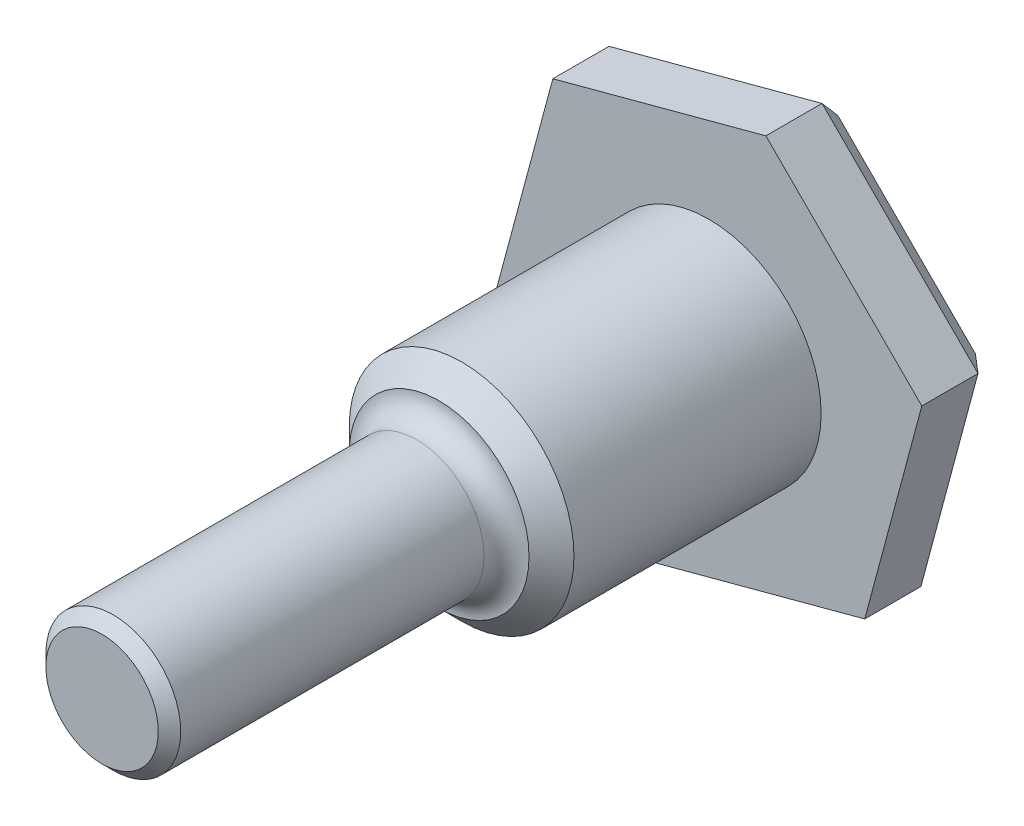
ISO-10303-21;
HEADER;
FILE_DESCRIPTION(('STEP AP214'),'2;1');
FILE_NAME('part.step','',(''),(''),'','','');
FILE_SCHEMA(('AUTOMOTIVE_DESIGN { 1 0 10303 214 1 1 1 1 }'));
ENDSEC;
DATA;
#1=APPLICATION_CONTEXT('core data for automotive mechanical design processes');
#2=APPLICATION_PROTOCOL_DEFINITION('international standard','automotive_design',2000,#1);
#3=PRODUCT_CONTEXT('',#1,'mechanical');
#4=PRODUCT('Part','Part','',(#3));
#5=PRODUCT_RELATED_PRODUCT_CATEGORY('part','',(#4));
#6=PRODUCT_DEFINITION_FORMATION('','',#4);
#7=PRODUCT_DEFINITION_CONTEXT('part definition',#1,'design');
#8=PRODUCT_DEFINITION('design','',#6,#7);
#9=PRODUCT_DEFINITION_SHAPE('','',#8);
#10=(LENGTH_UNIT() NAMED_UNIT(*) SI_UNIT(.MILLI.,.METRE.));
#11=(NAMED_UNIT(*) PLANE_ANGLE_UNIT() SI_UNIT($,.RADIAN.));
#12=(NAMED_UNIT(*) SI_UNIT($,.STERADIAN.) SOLID_ANGLE_UNIT());
#13=UNCERTAINTY_MEASURE_WITH_UNIT(LENGTH_MEASURE(1.E-05),#10,'distance_accuracy_value','');
#14=(GEOMETRIC_REPRESENTATION_CONTEXT(3) GLOBAL_UNCERTAINTY_ASSIGNED_CONTEXT((#13)) GLOBAL_UNIT_ASSIGNED_CONTEXT((#10,
#11,#12)) REPRESENTATION_CONTEXT('',''));
#15=CARTESIAN_POINT('',(0.,0.,0.));
#16=DIRECTION('',(0.,0.,1.));
#17=DIRECTION('',(1.,0.,0.));
#18=AXIS2_PLACEMENT_3D('',#15,#16,#17);
#19=CARTESIAN_POINT('',(6.94022093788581,-6.94022093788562,3.5));
#20=DIRECTION('',(0.,0.,1.));
#21=DIRECTION('',(1.,0.,0.));
#22=AXIS2_PLACEMENT_3D('',#19,#20,#21);
#23=PLANE('',#22);
#24=DIRECTION('',(0.965925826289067,0.258819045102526,0.));
#25=VECTOR('',#24,1.);
#26=CARTESIAN_POINT('',(-2.54029717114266,-9.48051810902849,3.5));
#27=LINE('',#26,#25);
#28=CARTESIAN_POINT('',(-2.54029717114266,-9.48051810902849,3.5));
#29=VERTEX_POINT('',#28);
#30=CARTESIAN_POINT('',(6.94022093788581,-6.94022093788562,3.5));
#31=VERTEX_POINT('',#30);
#32=EDGE_CURVE('E120',#29,#31,#27,.T.);
#33=ORIENTED_EDGE('',*,*,#32,.T.);
#34=DIRECTION('',(0.258819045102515,0.96592582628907,0.));
#35=VECTOR('',#34,1.);
#36=CARTESIAN_POINT('',(6.94022093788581,-6.94022093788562,3.5));
#37=LINE('',#36,#35);
#38=CARTESIAN_POINT('',(9.48051810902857,2.54029717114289,3.5));
#39=VERTEX_POINT('',#38);
#40=EDGE_CURVE('E108',#31,#39,#37,.T.);
#41=ORIENTED_EDGE('',*,*,#40,.T.);
#42=DIRECTION('',(-0.707106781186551,0.707106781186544,0.));
#43=VECTOR('',#42,1.);
#44=CARTESIAN_POINT('',(9.48051810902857,2.54029717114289,3.5));
#45=LINE('',#44,#43);
#46=CARTESIAN_POINT('',(2.54029717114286,9.48051810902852,3.5));
#47=VERTEX_POINT('',#46);
#48=EDGE_CURVE('E119',#39,#47,#45,.T.);
#49=ORIENTED_EDGE('',*,*,#48,.T.);
#50=DIRECTION('',(-0.965925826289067,-0.258819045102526,0.));
#51=VECTOR('',#50,1.);
#52=CARTESIAN_POINT('',(2.54029717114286,9.48051810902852,3.5));
#53=LINE('',#52,#51);
#54=CARTESIAN_POINT('',(-6.9402209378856,6.94022093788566,3.5));
#55=VERTEX_POINT('',#54);
#56=EDGE_CURVE('E401',#47,#55,#53,.T.);
#57=ORIENTED_EDGE('',*,*,#56,.T.);
#58=DIRECTION('',(-0.258819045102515,-0.96592582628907,0.));
#59=VECTOR('',#58,1.);
#60=CARTESIAN_POINT('',(-6.9402209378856,6.94022093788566,3.5));
#61=LINE('',#60,#59);
#62=CARTESIAN_POINT('',(-9.48051810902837,-2.54029717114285,3.5));
#63=VERTEX_POINT('',#62);
#64=EDGE_CURVE('E403',#55,#63,#61,.T.);
#65=ORIENTED_EDGE('',*,*,#64,.T.);
#66=DIRECTION('',(0.707106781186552,-0.707106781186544,0.));
#67=VECTOR('',#66,1.);
#68=CARTESIAN_POINT('',(-9.48051810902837,-2.54029717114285,3.5));
#69=LINE('',#68,#67);
#70=EDGE_CURVE('E125',#63,#29,#69,.T.);
#71=ORIENTED_EDGE('',*,*,#70,.T.);
#72=EDGE_LOOP('',(#33,#41,#49,#57,#65,#71));
#73=FACE_BOUND('',#72,.T.);
#74=CARTESIAN_POINT('',(0.,0.,3.5));
#75=DIRECTION('',(0.,0.,1.));
#76=DIRECTION('',(1.,0.,0.));
#77=AXIS2_PLACEMENT_3D('',#74,#75,#76);
#78=CIRCLE('',#77,5.);
#79=CARTESIAN_POINT('',(5.,0.,3.5));
#80=VERTEX_POINT('',#79);
#81=EDGE_CURVE('E127',#80,#80,#78,.T.);
#82=ORIENTED_EDGE('',*,*,#81,.F.);
#83=EDGE_LOOP('',(#82));
#84=FACE_BOUND('',#83,.T.);
#85=ADVANCED_FACE('F34',(#73,#84),#23,.T.);
#86=CARTESIAN_POINT('',(-2.54029717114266,-9.48051810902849,3.5));
#87=DIRECTION('',(-0.258819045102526,0.965925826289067,0.));
#88=DIRECTION('',(-0.965925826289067,-0.258819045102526,0.));
#89=AXIS2_PLACEMENT_3D('',#86,#87,#88);
#90=PLANE('',#89);
#91=DIRECTION('',(0.,0.,-1.));
#92=VECTOR('',#91,1.);
#93=CARTESIAN_POINT('',(-2.54029717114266,-9.48051810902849,3.5));
#94=LINE('',#93,#92);
#95=CARTESIAN_POINT('',(-2.54029717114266,-9.48051810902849,1.00000000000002));
#96=VERTEX_POINT('',#95);
#97=EDGE_CURVE('E406',#29,#96,#94,.T.);
#98=ORIENTED_EDGE('',*,*,#97,.T.);
#99=DIRECTION('',(0.965925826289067,0.258819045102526,0.));
#100=VECTOR('',#99,1.);
#101=CARTESIAN_POINT('',(-2.54029717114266,-9.48051810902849,1.00000000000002));
#102=LINE('',#101,#100);
#103=CARTESIAN_POINT('',(6.94022093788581,-6.94022093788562,1.00000000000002));
#104=VERTEX_POINT('',#103);
#105=EDGE_CURVE('E130',#96,#104,#102,.T.);
#106=ORIENTED_EDGE('',*,*,#105,.T.);
#107=DIRECTION('',(0.,0.,-1.));
#108=VECTOR('',#107,1.);
#109=CARTESIAN_POINT('',(6.94022093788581,-6.94022093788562,3.5));
#110=LINE('',#109,#108);
#111=EDGE_CURVE('E113',#31,#104,#110,.T.);
#112=ORIENTED_EDGE('',*,*,#111,.F.);
#113=ORIENTED_EDGE('',*,*,#32,.F.);
#114=EDGE_LOOP('',(#98,#106,#112,#113));
#115=FACE_BOUND('',#114,.T.);
#116=ADVANCED_FACE('F36',(#115),#90,.F.);
#117=CARTESIAN_POINT('',(6.94022093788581,-6.94022093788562,3.5));
#118=DIRECTION('',(-0.96592582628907,0.258819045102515,0.));
#119=DIRECTION('',(-0.258819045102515,-0.96592582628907,0.));
#120=AXIS2_PLACEMENT_3D('',#117,#118,#119);
#121=PLANE('',#120);
#122=ORIENTED_EDGE('',*,*,#111,.T.);
#123=DIRECTION('',(0.258819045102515,0.96592582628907,0.));
#124=VECTOR('',#123,1.);
#125=CARTESIAN_POINT('',(6.94022093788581,-6.94022093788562,1.00000000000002));
#126=LINE('',#125,#124);
#127=CARTESIAN_POINT('',(9.48051810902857,2.54029717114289,1.00000000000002));
#128=VERTEX_POINT('',#127);
#129=EDGE_CURVE('E142',#104,#128,#126,.T.);
#130=ORIENTED_EDGE('',*,*,#129,.T.);
#131=DIRECTION('',(0.,0.,-1.));
#132=VECTOR('',#131,1.);
#133=CARTESIAN_POINT('',(9.48051810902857,2.54029717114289,3.5));
#134=LINE('',#133,#132);
#135=EDGE_CURVE('E116',#39,#128,#134,.T.);
#136=ORIENTED_EDGE('',*,*,#135,.F.);
#137=ORIENTED_EDGE('',*,*,#40,.F.);
#138=EDGE_LOOP('',(#122,#130,#136,#137));
#139=FACE_BOUND('',#138,.T.);
#140=ADVANCED_FACE('F110',(#139),#121,.F.);
#141=CARTESIAN_POINT('',(9.48051810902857,2.54029717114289,3.5));
#142=DIRECTION('',(-0.707106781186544,-0.707106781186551,0.));
#143=DIRECTION('',(0.707106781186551,-0.707106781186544,0.));
#144=AXIS2_PLACEMENT_3D('',#141,#142,#143);
#145=PLANE('',#144);
#146=ORIENTED_EDGE('',*,*,#135,.T.);
#147=DIRECTION('',(-0.707106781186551,0.707106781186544,0.));
#148=VECTOR('',#147,1.);
#149=CARTESIAN_POINT('',(9.48051810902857,2.54029717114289,1.00000000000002));
#150=LINE('',#149,#148);
#151=CARTESIAN_POINT('',(2.54029717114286,9.48051810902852,1.00000000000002));
#152=VERTEX_POINT('',#151);
#153=EDGE_CURVE('E157',#128,#152,#150,.T.);
#154=ORIENTED_EDGE('',*,*,#153,.T.);
#155=DIRECTION('',(0.,0.,-1.));
#156=VECTOR('',#155,1.);
#157=CARTESIAN_POINT('',(2.54029717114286,9.48051810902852,3.5));
#158=LINE('',#157,#156);
#159=EDGE_CURVE('E136',#47,#152,#158,.T.);
#160=ORIENTED_EDGE('',*,*,#159,.F.);
#161=ORIENTED_EDGE('',*,*,#48,.F.);
#162=EDGE_LOOP('',(#146,#154,#160,#161));
#163=FACE_BOUND('',#162,.T.);
#164=ADVANCED_FACE('F202',(#163),#145,.F.);
#165=CARTESIAN_POINT('',(2.54029717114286,9.48051810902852,3.5));
#166=DIRECTION('',(0.258819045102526,-0.965925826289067,0.));
#167=DIRECTION('',(0.965925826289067,0.258819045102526,0.));
#168=AXIS2_PLACEMENT_3D('',#165,#166,#167);
#169=PLANE('',#168);
#170=ORIENTED_EDGE('',*,*,#159,.T.);
#171=DIRECTION('',(-0.965925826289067,-0.258819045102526,0.));
#172=VECTOR('',#171,1.);
#173=CARTESIAN_POINT('',(2.54029717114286,9.48051810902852,1.00000000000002));
#174=LINE('',#173,#172);
#175=CARTESIAN_POINT('',(-6.9402209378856,6.94022093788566,1.00000000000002));
#176=VERTEX_POINT('',#175);
#177=EDGE_CURVE('E159',#152,#176,#174,.T.);
#178=ORIENTED_EDGE('',*,*,#177,.T.);
#179=DIRECTION('',(0.,0.,-1.));
#180=VECTOR('',#179,1.);
#181=CARTESIAN_POINT('',(-6.9402209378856,6.94022093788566,3.5));
#182=LINE('',#181,#180);
#183=EDGE_CURVE('E410',#55,#176,#182,.T.);
#184=ORIENTED_EDGE('',*,*,#183,.F.);
#185=ORIENTED_EDGE('',*,*,#56,.F.);
#186=EDGE_LOOP('',(#170,#178,#184,#185));
#187=FACE_BOUND('',#186,.T.);
#188=ADVANCED_FACE('F199',(#187),#169,.F.);
#189=CARTESIAN_POINT('',(-6.9402209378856,6.94022093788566,3.5));
#190=DIRECTION('',(0.96592582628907,-0.258819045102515,0.));
#191=DIRECTION('',(0.258819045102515,0.96592582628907,0.));
#192=AXIS2_PLACEMENT_3D('',#189,#190,#191);
#193=PLANE('',#192);
#194=ORIENTED_EDGE('',*,*,#183,.T.);
#195=DIRECTION('',(-0.258819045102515,-0.96592582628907,0.));
#196=VECTOR('',#195,1.);
#197=CARTESIAN_POINT('',(-6.9402209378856,6.94022093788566,1.00000000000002));
#198=LINE('',#197,#196);
#199=CARTESIAN_POINT('',(-9.48051810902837,-2.54029717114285,1.00000000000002));
#200=VERTEX_POINT('',#199);
#201=EDGE_CURVE('E57',#176,#200,#198,.T.);
#202=ORIENTED_EDGE('',*,*,#201,.T.);
#203=DIRECTION('',(0.,0.,-1.));
#204=VECTOR('',#203,1.);
#205=CARTESIAN_POINT('',(-9.48051810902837,-2.54029717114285,3.5));
#206=LINE('',#205,#204);
#207=EDGE_CURVE('E408',#63,#200,#206,.T.);
#208=ORIENTED_EDGE('',*,*,#207,.F.);
#209=ORIENTED_EDGE('',*,*,#64,.F.);
#210=EDGE_LOOP('',(#194,#202,#208,#209));
#211=FACE_BOUND('',#210,.T.);
#212=ADVANCED_FACE('F196',(#211),#193,.F.);
#213=CARTESIAN_POINT('',(-9.48051810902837,-2.54029717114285,3.5));
#214=DIRECTION('',(0.707106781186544,0.707106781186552,0.));
#215=DIRECTION('',(-0.707106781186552,0.707106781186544,0.));
#216=AXIS2_PLACEMENT_3D('',#213,#214,#215);
#217=PLANE('',#216);
#218=ORIENTED_EDGE('',*,*,#207,.T.);
#219=DIRECTION('',(0.707106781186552,-0.707106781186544,0.));
#220=VECTOR('',#219,1.);
#221=CARTESIAN_POINT('',(-9.48051810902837,-2.54029717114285,1.00000000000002));
#222=LINE('',#221,#220);
#223=EDGE_CURVE('E49',#200,#96,#222,.T.);
#224=ORIENTED_EDGE('',*,*,#223,.T.);
#225=ORIENTED_EDGE('',*,*,#97,.F.);
#226=ORIENTED_EDGE('',*,*,#70,.F.);
#227=EDGE_LOOP('',(#218,#224,#225,#226));
#228=FACE_BOUND('',#227,.T.);
#229=ADVANCED_FACE('F193',(#228),#217,.F.);
#230=CARTESIAN_POINT('',(6.94022093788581,-6.94022093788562,0.));
#231=DIRECTION('',(0.,0.,1.));
#232=DIRECTION('',(1.,0.,0.));
#233=AXIS2_PLACEMENT_3D('',#230,#231,#232);
#234=PLANE('',#233);
#235=DIRECTION('',(0.707106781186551,-0.707106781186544,0.));
#236=VECTOR('',#235,1.);
#237=CARTESIAN_POINT('',(12.2435217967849,-1.63692007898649,0.));
#238=LINE('',#237,#236);
#239=CARTESIAN_POINT('',(2.24143868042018,8.3651630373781,0.));
#240=VERTEX_POINT('',#239);
#241=CARTESIAN_POINT('',(8.36516303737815,2.2414386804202,0.));
#242=VERTEX_POINT('',#241);
#243=EDGE_CURVE('E152',#240,#242,#238,.T.);
#244=ORIENTED_EDGE('',*,*,#243,.T.);
#245=DIRECTION('',(-0.258819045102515,-0.96592582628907,0.));
#246=VECTOR('',#245,1.);
#247=CARTESIAN_POINT('',(5.97429511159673,-6.6814018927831,0.));
#248=LINE('',#247,#246);
#249=CARTESIAN_POINT('',(6.12372435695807,-6.12372435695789,0.));
#250=VERTEX_POINT('',#249);
#251=EDGE_CURVE('E154',#242,#250,#248,.T.);
#252=ORIENTED_EDGE('',*,*,#251,.T.);
#253=DIRECTION('',(-0.965925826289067,-0.258819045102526,0.));
#254=VECTOR('',#253,1.);
#255=CARTESIAN_POINT('',(6.68140189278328,-5.97429511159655,0.));
#256=LINE('',#255,#254);
#257=CARTESIAN_POINT('',(-2.24143868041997,-8.36516303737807,0.));
#258=VERTEX_POINT('',#257);
#259=EDGE_CURVE('E144',#250,#258,#256,.T.);
#260=ORIENTED_EDGE('',*,*,#259,.T.);
#261=DIRECTION('',(-0.707106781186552,0.707106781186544,0.));
#262=VECTOR('',#261,1.);
#263=CARTESIAN_POINT('',(1.63692007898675,-12.2435217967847,0.));
#264=LINE('',#263,#262);
#265=CARTESIAN_POINT('',(-8.36516303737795,-2.24143868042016,0.));
#266=VERTEX_POINT('',#265);
#267=EDGE_CURVE('E146',#258,#266,#264,.T.);
#268=ORIENTED_EDGE('',*,*,#267,.T.);
#269=DIRECTION('',(0.258819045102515,0.96592582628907,0.));
#270=VECTOR('',#269,1.);
#271=CARTESIAN_POINT('',(-8.5145922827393,-2.79911621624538,0.));
#272=LINE('',#271,#270);
#273=CARTESIAN_POINT('',(-6.12372435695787,6.12372435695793,0.));
#274=VERTEX_POINT('',#273);
#275=EDGE_CURVE('E148',#266,#274,#272,.T.);
#276=ORIENTED_EDGE('',*,*,#275,.T.);
#277=DIRECTION('',(0.965925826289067,0.258819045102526,0.));
#278=VECTOR('',#277,1.);
#279=CARTESIAN_POINT('',(2.79911621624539,8.51459228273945,0.));
#280=LINE('',#279,#278);
#281=EDGE_CURVE('E150',#274,#240,#280,.T.);
#282=ORIENTED_EDGE('',*,*,#281,.T.);
#283=EDGE_LOOP('',(#244,#252,#260,#268,#276,#282));
#284=FACE_BOUND('',#283,.T.);
#285=ADVANCED_FACE('F191',(#284),#234,.F.);
#286=CARTESIAN_POINT('',(0.,0.,15.5));
#287=DIRECTION('',(0.,0.,-1.));
#288=DIRECTION('',(-1.,0.,0.));
#289=AXIS2_PLACEMENT_3D('',#286,#287,#288);
#290=CYLINDRICAL_SURFACE('',#289,5.);
#291=CARTESIAN_POINT('',(0.,0.,14.5));
#292=DIRECTION('',(0.,0.,1.));
#293=DIRECTION('',(1.,0.,0.));
#294=AXIS2_PLACEMENT_3D('',#291,#292,#293);
#295=CIRCLE('',#294,5.);
#296=CARTESIAN_POINT('',(5.,0.,14.5));
#297=VERTEX_POINT('',#296);
#298=EDGE_CURVE('E164',#297,#297,#295,.F.);
#299=ORIENTED_EDGE('',*,*,#298,.T.);
#300=EDGE_LOOP('',(#299));
#301=FACE_BOUND('',#300,.T.);
#302=ORIENTED_EDGE('',*,*,#81,.T.);
#303=EDGE_LOOP('',(#302));
#304=FACE_BOUND('',#303,.T.);
#305=ADVANCED_FACE('F235',(#301,#304),#290,.T.);
#306=CARTESIAN_POINT('',(0.,0.,30.5));
#307=DIRECTION('',(0.,0.,-1.));
#308=DIRECTION('',(-1.,0.,0.));
#309=AXIS2_PLACEMENT_3D('',#306,#307,#308);
#310=CYLINDRICAL_SURFACE('',#309,3.);
#311=CARTESIAN_POINT('',(0.,0.,30.));
#312=DIRECTION('',(0.,0.,1.));
#313=DIRECTION('',(1.,0.,0.));
#314=AXIS2_PLACEMENT_3D('',#311,#312,#313);
#315=CIRCLE('',#314,3.);
#316=CARTESIAN_POINT('',(3.,0.,30.));
#317=VERTEX_POINT('',#316);
#318=EDGE_CURVE('E11',#317,#317,#315,.F.);
#319=ORIENTED_EDGE('',*,*,#318,.T.);
#320=EDGE_LOOP('',(#319));
#321=FACE_BOUND('',#320,.T.);
#322=CARTESIAN_POINT('',(0.,0.,16.5));
#323=DIRECTION('',(0.,0.,1.));
#324=DIRECTION('',(1.,0.,0.));
#325=AXIS2_PLACEMENT_3D('',#322,#323,#324);
#326=CIRCLE('',#325,3.);
#327=CARTESIAN_POINT('',(3.,0.,16.5));
#328=VERTEX_POINT('',#327);
#329=EDGE_CURVE('E131',#328,#328,#326,.T.);
#330=ORIENTED_EDGE('',*,*,#329,.T.);
#331=EDGE_LOOP('',(#330));
#332=FACE_BOUND('',#331,.T.);
#333=ADVANCED_FACE('F240',(#321,#332),#310,.T.);
#334=CARTESIAN_POINT('',(0.,0.,30.5));
#335=DIRECTION('',(0.,0.,1.));
#336=DIRECTION('',(1.,0.,0.));
#337=AXIS2_PLACEMENT_3D('',#334,#335,#336);
#338=PLANE('',#337);
#339=CARTESIAN_POINT('',(0.,0.,30.5));
#340=DIRECTION('',(0.,0.,1.));
#341=DIRECTION('',(1.,0.,0.));
#342=AXIS2_PLACEMENT_3D('',#339,#340,#341);
#343=CIRCLE('',#342,2.5);
#344=CARTESIAN_POINT('',(2.5,0.,30.5));
#345=VERTEX_POINT('',#344);
#346=EDGE_CURVE('E42',#345,#345,#343,.T.);
#347=ORIENTED_EDGE('',*,*,#346,.T.);
#348=EDGE_LOOP('',(#347));
#349=FACE_BOUND('',#348,.T.);
#350=ADVANCED_FACE('F170',(#349),#338,.T.);
#351=CARTESIAN_POINT('',(0.,0.,16.5));
#352=DIRECTION('',(0.,0.,1.));
#353=DIRECTION('',(1.,0.,0.));
#354=AXIS2_PLACEMENT_3D('',#351,#352,#353);
#355=TOROIDAL_SURFACE('',#354,4.,1.);
#356=CARTESIAN_POINT('',(0.,0.,15.5));
#357=DIRECTION('',(0.,0.,1.));
#358=DIRECTION('',(1.,0.,0.));
#359=AXIS2_PLACEMENT_3D('',#356,#357,#358);
#360=CIRCLE('',#359,4.);
#361=CARTESIAN_POINT('',(4.,0.,15.5));
#362=VERTEX_POINT('',#361);
#363=EDGE_CURVE('E134',#362,#362,#360,.F.);
#364=ORIENTED_EDGE('',*,*,#363,.F.);
#365=EDGE_LOOP('',(#364));
#366=FACE_BOUND('',#365,.T.);
#367=ORIENTED_EDGE('',*,*,#329,.F.);
#368=EDGE_LOOP('',(#367));
#369=FACE_BOUND('',#368,.T.);
#370=ADVANCED_FACE('F255',(#366,#369),#355,.F.);
#371=CARTESIAN_POINT('',(-6.9402209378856,6.94022093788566,1.00000000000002));
#372=DIRECTION('',(0.683012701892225,-0.183012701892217,0.707106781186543));
#373=DIRECTION('',(0.719254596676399,0.,-0.694746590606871));
#374=AXIS2_PLACEMENT_3D('',#371,#372,#373);
#375=PLANE('',#374);
#376=DIRECTION('',(0.534522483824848,-0.534522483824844,-0.654653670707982));
#377=VECTOR('',#376,1.);
#378=CARTESIAN_POINT('',(-6.9402209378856,6.94022093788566,1.00000000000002));
#379=LINE('',#378,#377);
#380=EDGE_CURVE('E392',#274,#176,#379,.F.);
#381=ORIENTED_EDGE('',*,*,#380,.F.);
#382=ORIENTED_EDGE('',*,*,#275,.F.);
#383=DIRECTION('',(0.730171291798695,0.195648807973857,-0.654653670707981));
#384=VECTOR('',#383,1.);
#385=CARTESIAN_POINT('',(-9.48051810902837,-2.54029717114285,1.00000000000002));
#386=LINE('',#385,#384);
#387=EDGE_CURVE('E395',#200,#266,#386,.T.);
#388=ORIENTED_EDGE('',*,*,#387,.F.);
#389=ORIENTED_EDGE('',*,*,#201,.F.);
#390=EDGE_LOOP('',(#381,#382,#388,#389));
#391=FACE_BOUND('',#390,.T.);
#392=ADVANCED_FACE('F262',(#391),#375,.F.);
#393=CARTESIAN_POINT('',(-9.48051810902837,-2.54029717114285,1.00000000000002));
#394=DIRECTION('',(0.5,0.500000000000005,0.707106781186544));
#395=DIRECTION('',(0.,-0.816496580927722,0.577350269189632));
#396=AXIS2_PLACEMENT_3D('',#393,#394,#395);
#397=PLANE('',#396);
#398=ORIENTED_EDGE('',*,*,#387,.T.);
#399=ORIENTED_EDGE('',*,*,#267,.F.);
#400=DIRECTION('',(0.195648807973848,0.730171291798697,-0.654653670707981));
#401=VECTOR('',#400,1.);
#402=CARTESIAN_POINT('',(-2.54029717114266,-9.48051810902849,1.00000000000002));
#403=LINE('',#402,#401);
#404=EDGE_CURVE('E381',#96,#258,#403,.T.);
#405=ORIENTED_EDGE('',*,*,#404,.F.);
#406=ORIENTED_EDGE('',*,*,#223,.F.);
#407=EDGE_LOOP('',(#398,#399,#405,#406));
#408=FACE_BOUND('',#407,.T.);
#409=ADVANCED_FACE('F271',(#408),#397,.F.);
#410=CARTESIAN_POINT('',(2.54029717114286,9.48051810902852,1.00000000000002));
#411=DIRECTION('',(0.183012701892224,-0.683012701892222,0.707106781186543));
#412=DIRECTION('',(0.,-0.7192545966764,-0.694746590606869));
#413=AXIS2_PLACEMENT_3D('',#410,#411,#412);
#414=PLANE('',#413);
#415=ORIENTED_EDGE('',*,*,#380,.T.);
#416=ORIENTED_EDGE('',*,*,#177,.F.);
#417=DIRECTION('',(-0.195648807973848,-0.730171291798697,-0.654653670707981));
#418=VECTOR('',#417,1.);
#419=CARTESIAN_POINT('',(2.54029717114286,9.48051810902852,1.00000000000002));
#420=LINE('',#419,#418);
#421=EDGE_CURVE('E376',#240,#152,#420,.F.);
#422=ORIENTED_EDGE('',*,*,#421,.F.);
#423=ORIENTED_EDGE('',*,*,#281,.F.);
#424=EDGE_LOOP('',(#415,#416,#422,#423));
#425=FACE_BOUND('',#424,.T.);
#426=ADVANCED_FACE('F280',(#425),#414,.F.);
#427=CARTESIAN_POINT('',(-2.54029717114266,-9.48051810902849,1.00000000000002));
#428=DIRECTION('',(-0.183012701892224,0.683012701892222,0.707106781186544));
#429=DIRECTION('',(0.,-0.7192545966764,0.694746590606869));
#430=AXIS2_PLACEMENT_3D('',#427,#428,#429);
#431=PLANE('',#430);
#432=ORIENTED_EDGE('',*,*,#404,.T.);
#433=ORIENTED_EDGE('',*,*,#259,.F.);
#434=DIRECTION('',(0.534522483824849,-0.534522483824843,0.654653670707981));
#435=VECTOR('',#434,1.);
#436=CARTESIAN_POINT('',(4.95730066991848,-4.95730066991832,-1.42857142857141));
#437=LINE('',#436,#435);
#438=EDGE_CURVE('E373',#104,#250,#437,.F.);
#439=ORIENTED_EDGE('',*,*,#438,.F.);
#440=ORIENTED_EDGE('',*,*,#105,.F.);
#441=EDGE_LOOP('',(#432,#433,#439,#440));
#442=FACE_BOUND('',#441,.T.);
#443=ADVANCED_FACE('F288',(#442),#431,.F.);
#444=CARTESIAN_POINT('',(9.48051810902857,2.54029717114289,1.00000000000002));
#445=DIRECTION('',(-0.5,-0.500000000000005,0.707106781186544));
#446=DIRECTION('',(0.,-0.816496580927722,-0.577350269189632));
#447=AXIS2_PLACEMENT_3D('',#444,#445,#446);
#448=PLANE('',#447);
#449=ORIENTED_EDGE('',*,*,#421,.T.);
#450=ORIENTED_EDGE('',*,*,#153,.F.);
#451=DIRECTION('',(-0.730171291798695,-0.195648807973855,-0.654653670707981));
#452=VECTOR('',#451,1.);
#453=CARTESIAN_POINT('',(9.48051810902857,2.54029717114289,1.00000000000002));
#454=LINE('',#453,#452);
#455=EDGE_CURVE('E377',#242,#128,#454,.F.);
#456=ORIENTED_EDGE('',*,*,#455,.F.);
#457=ORIENTED_EDGE('',*,*,#243,.F.);
#458=EDGE_LOOP('',(#449,#450,#456,#457));
#459=FACE_BOUND('',#458,.T.);
#460=ADVANCED_FACE('F296',(#459),#448,.F.);
#461=CARTESIAN_POINT('',(6.94022093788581,-6.94022093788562,1.00000000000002));
#462=DIRECTION('',(-0.683012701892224,0.183012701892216,0.707106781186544));
#463=DIRECTION('',(0.719254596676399,0.,0.69474659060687));
#464=AXIS2_PLACEMENT_3D('',#461,#462,#463);
#465=PLANE('',#464);
#466=ORIENTED_EDGE('',*,*,#438,.T.);
#467=ORIENTED_EDGE('',*,*,#251,.F.);
#468=ORIENTED_EDGE('',*,*,#455,.T.);
#469=ORIENTED_EDGE('',*,*,#129,.F.);
#470=EDGE_LOOP('',(#466,#467,#468,#469));
#471=FACE_BOUND('',#470,.T.);
#472=ADVANCED_FACE('F180',(#471),#465,.F.);
#473=CARTESIAN_POINT('',(0.,0.,15.5));
#474=DIRECTION('',(0.,0.,-1.));
#475=DIRECTION('',(-1.,0.,0.));
#476=AXIS2_PLACEMENT_3D('',#473,#474,#475);
#477=CONICAL_SURFACE('',#476,3.99999999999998,0.785398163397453);
#478=ORIENTED_EDGE('',*,*,#298,.F.);
#479=EDGE_LOOP('',(#478));
#480=FACE_BOUND('',#479,.T.);
#481=ORIENTED_EDGE('',*,*,#363,.T.);
#482=EDGE_LOOP('',(#481));
#483=FACE_BOUND('',#482,.T.);
#484=ADVANCED_FACE('F174',(#480,#483),#477,.T.);
#485=CARTESIAN_POINT('',(0.,0.,30.5));
#486=DIRECTION('',(0.,0.,-1.));
#487=DIRECTION('',(-1.,0.,0.));
#488=AXIS2_PLACEMENT_3D('',#485,#486,#487);
#489=CONICAL_SURFACE('',#488,2.5,0.785398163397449);
#490=ORIENTED_EDGE('',*,*,#318,.F.);
#491=EDGE_LOOP('',(#490));
#492=FACE_BOUND('',#491,.T.);
#493=ORIENTED_EDGE('',*,*,#346,.F.);
#494=EDGE_LOOP('',(#493));
#495=FACE_BOUND('',#494,.T.);
#496=ADVANCED_FACE('F172',(#492,#495),#489,.T.);
#497=CLOSED_SHELL('',(#85,#116,#140,#164,#188,#212,#229,#285,#305,#333,#350,#370,#392,#409,#426,
#443,#460,#472,#484,#496));
#498=MANIFOLD_SOLID_BREP('B2',#497);
#499=ADVANCED_BREP_SHAPE_REPRESENTATION('',(#18,#498),#14);
#500=SHAPE_DEFINITION_REPRESENTATION(#9,#499);
ENDSEC;
END-ISO-10303-21;
